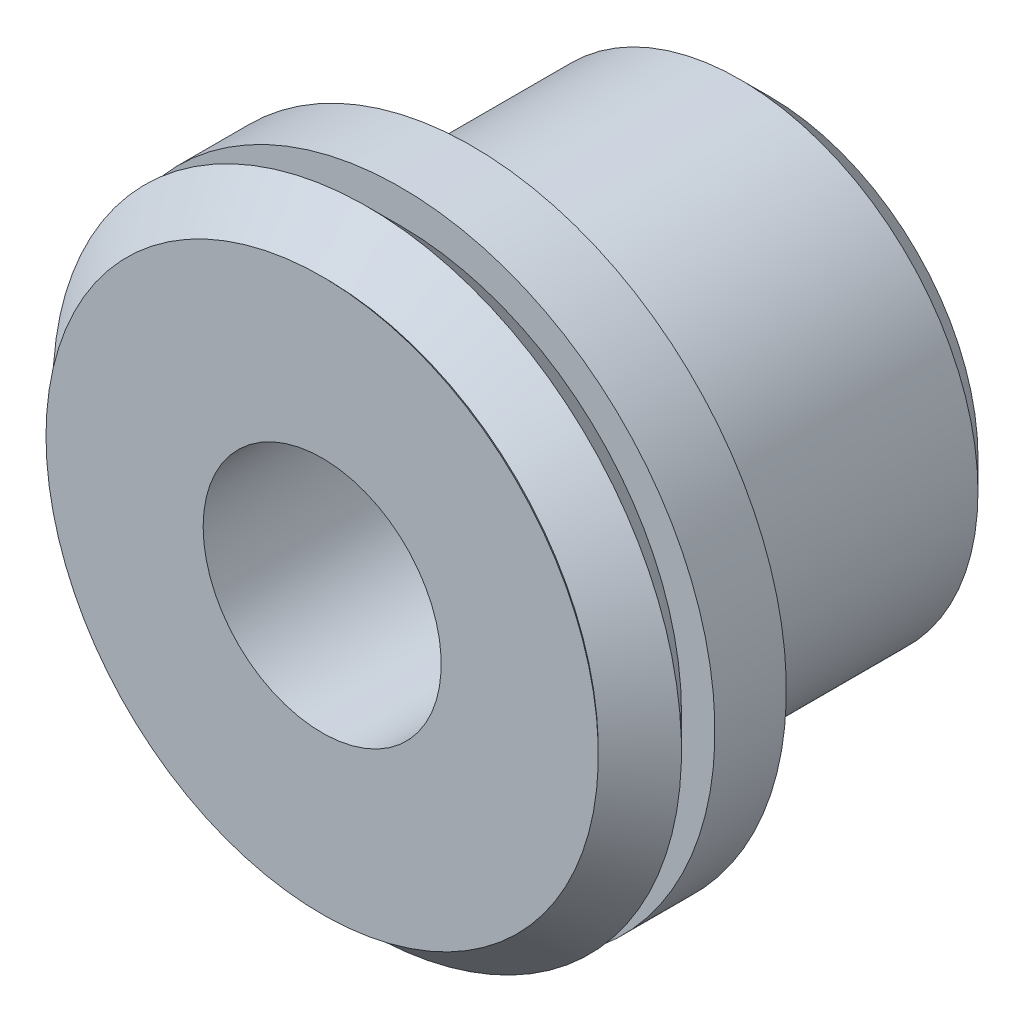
ISO-10303-21;
HEADER;
FILE_DESCRIPTION(('STEP AP214'),'2;1');
FILE_NAME('part.step','',(''),(''),'','','');
FILE_SCHEMA(('AUTOMOTIVE_DESIGN { 1 0 10303 214 1 1 1 1 }'));
ENDSEC;
DATA;
#1=APPLICATION_CONTEXT('core data for automotive mechanical design processes');
#2=APPLICATION_PROTOCOL_DEFINITION('international standard','automotive_design',2000,#1);
#3=PRODUCT_CONTEXT('',#1,'mechanical');
#4=PRODUCT('Part','Part','',(#3));
#5=PRODUCT_RELATED_PRODUCT_CATEGORY('part','',(#4));
#6=PRODUCT_DEFINITION_FORMATION('','',#4);
#7=PRODUCT_DEFINITION_CONTEXT('part definition',#1,'design');
#8=PRODUCT_DEFINITION('design','',#6,#7);
#9=PRODUCT_DEFINITION_SHAPE('','',#8);
#10=(LENGTH_UNIT() NAMED_UNIT(*) SI_UNIT(.MILLI.,.METRE.));
#11=(NAMED_UNIT(*) PLANE_ANGLE_UNIT() SI_UNIT($,.RADIAN.));
#12=(NAMED_UNIT(*) SI_UNIT($,.STERADIAN.) SOLID_ANGLE_UNIT());
#13=UNCERTAINTY_MEASURE_WITH_UNIT(LENGTH_MEASURE(1.E-05),#10,'distance_accuracy_value','');
#14=(GEOMETRIC_REPRESENTATION_CONTEXT(3) GLOBAL_UNCERTAINTY_ASSIGNED_CONTEXT((#13)) GLOBAL_UNIT_ASSIGNED_CONTEXT((#10,
#11,#12)) REPRESENTATION_CONTEXT('',''));
#15=CARTESIAN_POINT('',(0.,0.,0.));
#16=DIRECTION('',(0.,0.,1.));
#17=DIRECTION('',(1.,0.,0.));
#18=AXIS2_PLACEMENT_3D('',#15,#16,#17);
#19=CARTESIAN_POINT('',(0.,0.,0.));
#20=DIRECTION('',(0.,0.,1.));
#21=DIRECTION('',(1.,0.,0.));
#22=AXIS2_PLACEMENT_3D('',#19,#20,#21);
#23=PLANE('',#22);
#24=CARTESIAN_POINT('',(0.,0.,0.));
#25=DIRECTION('',(0.,0.,-1.));
#26=DIRECTION('',(-1.,0.,0.));
#27=AXIS2_PLACEMENT_3D('',#24,#25,#26);
#28=CIRCLE('',#27,7.366);
#29=CARTESIAN_POINT('',(-7.366,0.,0.));
#30=VERTEX_POINT('',#29);
#31=EDGE_CURVE('E45',#30,#30,#28,.T.);
#32=ORIENTED_EDGE('',*,*,#31,.F.);
#33=EDGE_LOOP('',(#32));
#34=FACE_BOUND('',#33,.T.);
#35=CARTESIAN_POINT('',(0.,0.,0.));
#36=DIRECTION('',(0.,0.,-1.));
#37=DIRECTION('',(-1.,0.,0.));
#38=AXIS2_PLACEMENT_3D('',#35,#36,#37);
#39=CIRCLE('',#38,3.175);
#40=CARTESIAN_POINT('',(-3.175,0.,0.));
#41=VERTEX_POINT('',#40);
#42=EDGE_CURVE('E66',#41,#41,#39,.T.);
#43=ORIENTED_EDGE('',*,*,#42,.T.);
#44=EDGE_LOOP('',(#43));
#45=FACE_BOUND('',#44,.T.);
#46=ADVANCED_FACE('F30',(#34,#45),#23,.T.);
#47=CARTESIAN_POINT('',(0.,0.,-11.935714));
#48=DIRECTION('',(0.,0.,1.));
#49=DIRECTION('',(1.,0.,0.));
#50=AXIS2_PLACEMENT_3D('',#47,#48,#49);
#51=PLANE('',#50);
#52=CARTESIAN_POINT('',(0.,0.,-11.935714));
#53=DIRECTION('',(0.,0.,1.));
#54=DIRECTION('',(1.,0.,0.));
#55=AXIS2_PLACEMENT_3D('',#52,#53,#54);
#56=CIRCLE('',#55,5.55624999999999);
#57=CARTESIAN_POINT('',(5.55624999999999,0.,-11.935714));
#58=VERTEX_POINT('',#57);
#59=EDGE_CURVE('E10',#58,#58,#56,.F.);
#60=ORIENTED_EDGE('',*,*,#59,.T.);
#61=EDGE_LOOP('',(#60));
#62=FACE_BOUND('',#61,.T.);
#63=CARTESIAN_POINT('',(0.,0.,-11.935714));
#64=DIRECTION('',(0.,0.,-1.));
#65=DIRECTION('',(-1.,0.,0.));
#66=AXIS2_PLACEMENT_3D('',#63,#64,#65);
#67=CIRCLE('',#66,3.175);
#68=CARTESIAN_POINT('',(-3.175,0.,-11.935714));
#69=VERTEX_POINT('',#68);
#70=EDGE_CURVE('E65',#69,#69,#67,.T.);
#71=ORIENTED_EDGE('',*,*,#70,.F.);
#72=EDGE_LOOP('',(#71));
#73=FACE_BOUND('',#72,.T.);
#74=ADVANCED_FACE('F75',(#62,#73),#51,.F.);
#75=CARTESIAN_POINT('',(0.,0.,-0.0927099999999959));
#76=DIRECTION('',(0.,0.,1.));
#77=DIRECTION('',(1.,0.,0.));
#78=AXIS2_PLACEMENT_3D('',#75,#76,#77);
#79=CONICAL_SURFACE('',#78,7.27329,0.785398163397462);
#80=ORIENTED_EDGE('',*,*,#31,.T.);
#81=EDGE_LOOP('',(#80));
#82=FACE_BOUND('',#81,.T.);
#83=CARTESIAN_POINT('',(0.,0.,-0.0927099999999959));
#84=DIRECTION('',(0.,0.,-1.));
#85=DIRECTION('',(-1.,0.,0.));
#86=AXIS2_PLACEMENT_3D('',#83,#84,#85);
#87=CIRCLE('',#86,7.27329);
#88=CARTESIAN_POINT('',(-7.27329,0.,-0.0927099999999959));
#89=VERTEX_POINT('',#88);
#90=EDGE_CURVE('E50',#89,#89,#87,.T.);
#91=ORIENTED_EDGE('',*,*,#90,.F.);
#92=EDGE_LOOP('',(#91));
#93=FACE_BOUND('',#92,.T.);
#94=ADVANCED_FACE('F77',(#82,#93),#79,.T.);
#95=CARTESIAN_POINT('',(0.,0.,-1.20141999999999));
#96=DIRECTION('',(0.,0.,-1.));
#97=DIRECTION('',(-1.,0.,0.));
#98=AXIS2_PLACEMENT_3D('',#95,#96,#97);
#99=CONICAL_SURFACE('',#98,8.38199999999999,0.785398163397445);
#100=ORIENTED_EDGE('',*,*,#90,.T.);
#101=EDGE_LOOP('',(#100));
#102=FACE_BOUND('',#101,.T.);
#103=CARTESIAN_POINT('',(0.,0.,-1.20141999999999));
#104=DIRECTION('',(0.,0.,-1.));
#105=DIRECTION('',(-1.,0.,0.));
#106=AXIS2_PLACEMENT_3D('',#103,#104,#105);
#107=CIRCLE('',#106,8.38199999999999);
#108=CARTESIAN_POINT('',(-8.38199999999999,0.,-1.20141999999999));
#109=VERTEX_POINT('',#108);
#110=EDGE_CURVE('E53',#109,#109,#107,.T.);
#111=ORIENTED_EDGE('',*,*,#110,.F.);
#112=EDGE_LOOP('',(#111));
#113=FACE_BOUND('',#112,.T.);
#114=ADVANCED_FACE('F83',(#102,#113),#99,.T.);
#115=CARTESIAN_POINT('',(0.,0.,-2.093214));
#116=DIRECTION('',(0.,0.,1.));
#117=DIRECTION('',(1.,0.,0.));
#118=AXIS2_PLACEMENT_3D('',#115,#116,#117);
#119=CONICAL_SURFACE('',#118,7.49020599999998,0.785398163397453);
#120=ORIENTED_EDGE('',*,*,#110,.T.);
#121=EDGE_LOOP('',(#120));
#122=FACE_BOUND('',#121,.T.);
#123=CARTESIAN_POINT('',(0.,0.,-2.093214));
#124=DIRECTION('',(0.,0.,-1.));
#125=DIRECTION('',(-1.,0.,0.));
#126=AXIS2_PLACEMENT_3D('',#123,#124,#125);
#127=CIRCLE('',#126,7.49020599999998);
#128=CARTESIAN_POINT('',(-7.49020599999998,0.,-2.093214));
#129=VERTEX_POINT('',#128);
#130=EDGE_CURVE('E56',#129,#129,#127,.T.);
#131=ORIENTED_EDGE('',*,*,#130,.F.);
#132=EDGE_LOOP('',(#131));
#133=FACE_BOUND('',#132,.T.);
#134=ADVANCED_FACE('F103',(#122,#133),#119,.T.);
#135=CARTESIAN_POINT('',(0.,7.49020599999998,-2.093214));
#136=DIRECTION('',(0.,0.,1.));
#137=DIRECTION('',(1.,0.,0.));
#138=AXIS2_PLACEMENT_3D('',#135,#136,#137);
#139=PLANE('',#138);
#140=ORIENTED_EDGE('',*,*,#130,.T.);
#141=EDGE_LOOP('',(#140));
#142=FACE_BOUND('',#141,.T.);
#143=CARTESIAN_POINT('',(0.,0.,-2.093214));
#144=DIRECTION('',(0.,0.,-1.));
#145=DIRECTION('',(-1.,0.,0.));
#146=AXIS2_PLACEMENT_3D('',#143,#144,#145);
#147=CIRCLE('',#146,8.38199999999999);
#148=CARTESIAN_POINT('',(-8.38199999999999,0.,-2.093214));
#149=VERTEX_POINT('',#148);
#150=EDGE_CURVE('E59',#149,#149,#147,.T.);
#151=ORIENTED_EDGE('',*,*,#150,.F.);
#152=EDGE_LOOP('',(#151));
#153=FACE_BOUND('',#152,.T.);
#154=ADVANCED_FACE('F99',(#142,#153),#139,.T.);
#155=CARTESIAN_POINT('',(0.,0.,-71.2941240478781));
#156=DIRECTION('',(0.,0.,-1.));
#157=DIRECTION('',(-1.,0.,0.));
#158=AXIS2_PLACEMENT_3D('',#155,#156,#157);
#159=CYLINDRICAL_SURFACE('',#158,8.38199999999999);
#160=ORIENTED_EDGE('',*,*,#150,.T.);
#161=EDGE_LOOP('',(#160));
#162=FACE_BOUND('',#161,.T.);
#163=CARTESIAN_POINT('',(0.,0.,-3.998214));
#164=DIRECTION('',(0.,0.,-1.));
#165=DIRECTION('',(-1.,0.,0.));
#166=AXIS2_PLACEMENT_3D('',#163,#164,#165);
#167=CIRCLE('',#166,8.38199999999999);
#168=CARTESIAN_POINT('',(-8.38199999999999,0.,-3.998214));
#169=VERTEX_POINT('',#168);
#170=EDGE_CURVE('E62',#169,#169,#167,.T.);
#171=ORIENTED_EDGE('',*,*,#170,.F.);
#172=EDGE_LOOP('',(#171));
#173=FACE_BOUND('',#172,.T.);
#174=ADVANCED_FACE('F95',(#162,#173),#159,.T.);
#175=CARTESIAN_POINT('',(0.,8.38199999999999,-3.998214));
#176=DIRECTION('',(0.,0.,-1.));
#177=DIRECTION('',(-1.,0.,0.));
#178=AXIS2_PLACEMENT_3D('',#175,#176,#177);
#179=PLANE('',#178);
#180=CARTESIAN_POINT('',(0.,0.,-3.998214));
#181=DIRECTION('',(0.,0.,-1.));
#182=DIRECTION('',(-1.,0.,0.));
#183=AXIS2_PLACEMENT_3D('',#180,#181,#182);
#184=CIRCLE('',#183,6.35);
#185=CARTESIAN_POINT('',(-6.35,0.,-3.998214));
#186=VERTEX_POINT('',#185);
#187=EDGE_CURVE('E41',#186,#186,#184,.T.);
#188=ORIENTED_EDGE('',*,*,#187,.F.);
#189=EDGE_LOOP('',(#188));
#190=FACE_BOUND('',#189,.T.);
#191=ORIENTED_EDGE('',*,*,#170,.T.);
#192=EDGE_LOOP('',(#191));
#193=FACE_BOUND('',#192,.T.);
#194=ADVANCED_FACE('F92',(#190,#193),#179,.T.);
#195=CARTESIAN_POINT('',(0.,0.,-11.935714));
#196=DIRECTION('',(0.,0.,1.));
#197=DIRECTION('',(1.,0.,0.));
#198=AXIS2_PLACEMENT_3D('',#195,#196,#197);
#199=CYLINDRICAL_SURFACE('',#198,6.35);
#200=CARTESIAN_POINT('',(0.,0.,-11.141964));
#201=DIRECTION('',(0.,0.,1.));
#202=DIRECTION('',(1.,0.,0.));
#203=AXIS2_PLACEMENT_3D('',#200,#201,#202);
#204=CIRCLE('',#203,6.35);
#205=CARTESIAN_POINT('',(6.35,0.,-11.141964));
#206=VERTEX_POINT('',#205);
#207=EDGE_CURVE('E37',#206,#206,#204,.T.);
#208=ORIENTED_EDGE('',*,*,#207,.T.);
#209=EDGE_LOOP('',(#208));
#210=FACE_BOUND('',#209,.T.);
#211=ORIENTED_EDGE('',*,*,#187,.T.);
#212=EDGE_LOOP('',(#211));
#213=FACE_BOUND('',#212,.T.);
#214=ADVANCED_FACE('F89',(#210,#213),#199,.T.);
#215=CARTESIAN_POINT('',(0.,0.,-11.141964));
#216=DIRECTION('',(0.,0.,1.));
#217=DIRECTION('',(1.,0.,0.));
#218=AXIS2_PLACEMENT_3D('',#215,#216,#217);
#219=CONICAL_SURFACE('',#218,6.35,0.78539816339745);
#220=CARTESIAN_POINT('',(5.55624999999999,0.,-11.935714));
#221=CARTESIAN_POINT('',(5.56451822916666,0.,-11.9274457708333));
#222=CARTESIAN_POINT('',(5.57278645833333,0.,-11.9191775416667));
#223=CARTESIAN_POINT('',(5.58932291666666,0.,-11.9026410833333));
#224=CARTESIAN_POINT('',(5.59759114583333,0.,-11.8943728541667));
#225=CARTESIAN_POINT('',(5.61412760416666,0.,-11.8778363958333));
#226=CARTESIAN_POINT('',(5.62239583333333,0.,-11.8695681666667));
#227=CARTESIAN_POINT('',(5.63893229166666,0.,-11.8530317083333));
#228=CARTESIAN_POINT('',(5.64720052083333,0.,-11.8447634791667));
#229=CARTESIAN_POINT('',(5.66373697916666,0.,-11.8282270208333));
#230=CARTESIAN_POINT('',(5.67200520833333,0.,-11.8199587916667));
#231=CARTESIAN_POINT('',(5.68854166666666,0.,-11.8034223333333));
#232=CARTESIAN_POINT('',(5.69680989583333,0.,-11.7951541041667));
#233=CARTESIAN_POINT('',(5.71334635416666,0.,-11.7786176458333));
#234=CARTESIAN_POINT('',(5.72161458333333,0.,-11.7703494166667));
#235=CARTESIAN_POINT('',(5.73815104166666,0.,-11.7538129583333));
#236=CARTESIAN_POINT('',(5.74641927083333,0.,-11.7455447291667));
#237=CARTESIAN_POINT('',(5.76295572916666,0.,-11.7290082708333));
#238=CARTESIAN_POINT('',(5.77122395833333,0.,-11.7207400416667));
#239=CARTESIAN_POINT('',(5.78776041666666,0.,-11.7042035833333));
#240=CARTESIAN_POINT('',(5.79602864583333,0.,-11.6959353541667));
#241=CARTESIAN_POINT('',(5.81256510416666,0.,-11.6793988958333));
#242=CARTESIAN_POINT('',(5.82083333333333,0.,-11.6711306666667));
#243=CARTESIAN_POINT('',(5.83736979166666,0.,-11.6545942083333));
#244=CARTESIAN_POINT('',(5.84563802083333,0.,-11.6463259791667));
#245=CARTESIAN_POINT('',(5.86217447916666,0.,-11.6297895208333));
#246=CARTESIAN_POINT('',(5.87044270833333,0.,-11.6215212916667));
#247=CARTESIAN_POINT('',(5.88697916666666,0.,-11.6049848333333));
#248=CARTESIAN_POINT('',(5.89524739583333,0.,-11.5967166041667));
#249=CARTESIAN_POINT('',(5.91178385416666,0.,-11.5801801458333));
#250=CARTESIAN_POINT('',(5.92005208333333,0.,-11.5719119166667));
#251=CARTESIAN_POINT('',(5.93658854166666,0.,-11.5553754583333));
#252=CARTESIAN_POINT('',(5.94485677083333,0.,-11.5471072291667));
#253=CARTESIAN_POINT('',(5.96139322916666,0.,-11.5305707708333));
#254=CARTESIAN_POINT('',(5.96966145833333,0.,-11.5223025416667));
#255=CARTESIAN_POINT('',(5.98619791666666,0.,-11.5057660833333));
#256=CARTESIAN_POINT('',(5.99446614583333,0.,-11.4974978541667));
#257=CARTESIAN_POINT('',(6.01100260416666,0.,-11.4809613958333));
#258=CARTESIAN_POINT('',(6.01927083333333,0.,-11.4726931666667));
#259=CARTESIAN_POINT('',(6.03580729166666,0.,-11.4561567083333));
#260=CARTESIAN_POINT('',(6.04407552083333,0.,-11.4478884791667));
#261=CARTESIAN_POINT('',(6.06061197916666,0.,-11.4313520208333));
#262=CARTESIAN_POINT('',(6.06888020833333,0.,-11.4230837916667));
#263=CARTESIAN_POINT('',(6.08541666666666,0.,-11.4065473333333));
#264=CARTESIAN_POINT('',(6.09368489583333,0.,-11.3982791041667));
#265=CARTESIAN_POINT('',(6.11022135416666,0.,-11.3817426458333));
#266=CARTESIAN_POINT('',(6.11848958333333,0.,-11.3734744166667));
#267=CARTESIAN_POINT('',(6.13502604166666,0.,-11.3569379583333));
#268=CARTESIAN_POINT('',(6.14329427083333,0.,-11.3486697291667));
#269=CARTESIAN_POINT('',(6.15983072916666,0.,-11.3321332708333));
#270=CARTESIAN_POINT('',(6.16809895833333,0.,-11.3238650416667));
#271=CARTESIAN_POINT('',(6.18463541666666,0.,-11.3073285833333));
#272=CARTESIAN_POINT('',(6.19290364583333,0.,-11.2990603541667));
#273=CARTESIAN_POINT('',(6.20944010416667,0.,-11.2825238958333));
#274=CARTESIAN_POINT('',(6.21770833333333,0.,-11.2742556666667));
#275=CARTESIAN_POINT('',(6.23424479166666,0.,-11.2577192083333));
#276=CARTESIAN_POINT('',(6.24251302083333,0.,-11.2494509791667));
#277=CARTESIAN_POINT('',(6.25904947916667,0.,-11.2329145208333));
#278=CARTESIAN_POINT('',(6.26731770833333,0.,-11.2246462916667));
#279=CARTESIAN_POINT('',(6.28385416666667,0.,-11.2081098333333));
#280=CARTESIAN_POINT('',(6.29212239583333,0.,-11.1998416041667));
#281=CARTESIAN_POINT('',(6.30865885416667,0.,-11.1833051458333));
#282=CARTESIAN_POINT('',(6.31692708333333,0.,-11.1750369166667));
#283=CARTESIAN_POINT('',(6.33346354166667,0.,-11.1585004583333));
#284=CARTESIAN_POINT('',(6.34173177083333,0.,-11.1502322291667));
#285=CARTESIAN_POINT('',(6.35,0.,-11.141964));
#286=B_SPLINE_CURVE_WITH_KNOTS('',3,(#220,#221,#222,#223,#224,#225,#226,#227,#228,#229,#230,
#231,#232,#233,#234,#235,#236,#237,#238,#239,#240,#241,#242,#243,#244,#245,#246,#247,#248,#249,
#250,#251,#252,#253,#254,#255,#256,#257,#258,#259,#260,#261,#262,#263,#264,#265,#266,#267,#268,
#269,#270,#271,#272,#273,#274,#275,#276,#277,#278,#279,#280,#281,#282,#283,#284,#285),
.UNSPECIFIED.,.F.,.F.,(4,2,2,2,2,2,2,2,2,2,2,2,2,2,2,2,2,2,2,2,2,2,2,2,2,2,2,2,2,2,2,2,4),(0.,
0.0350791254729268,0.070158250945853,0.10523737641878,0.140316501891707,0.175395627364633,
0.21047475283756,0.245553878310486,0.280633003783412,0.315712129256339,0.350791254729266,
0.385870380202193,0.420949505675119,0.456028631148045,0.491107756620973,0.526186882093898,
0.561266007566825,0.596345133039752,0.631424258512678,0.666503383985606,0.701582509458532,
0.736661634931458,0.771740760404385,0.806819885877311,0.841899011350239,0.876978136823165,
0.912057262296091,0.947136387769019,0.982215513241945,1.01729463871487,1.0523737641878,
1.08745288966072,1.12253201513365),.UNSPECIFIED.);
#287=EDGE_CURVE('BSEAM32',#58,#206,#286,.T.);
#288=ORIENTED_EDGE('',*,*,#59,.F.);
#289=ORIENTED_EDGE('',*,*,#207,.F.);
#290=ORIENTED_EDGE('',*,*,#287,.T.);
#291=ORIENTED_EDGE('',*,*,#287,.F.);
#292=EDGE_LOOP('',(#288,#290,#289,#291));
#293=FACE_BOUND('',#292,.T.);
#294=ADVANCED_FACE('F32',(#293),#219,.T.);
#295=CARTESIAN_POINT('',(0.,0.,-11.935714));
#296=DIRECTION('',(0.,0.,1.));
#297=DIRECTION('',(1.,0.,0.));
#298=AXIS2_PLACEMENT_3D('',#295,#296,#297);
#299=CYLINDRICAL_SURFACE('',#298,3.175);
#300=ORIENTED_EDGE('',*,*,#70,.T.);
#301=EDGE_LOOP('',(#300));
#302=FACE_BOUND('',#301,.T.);
#303=ORIENTED_EDGE('',*,*,#42,.F.);
#304=EDGE_LOOP('',(#303));
#305=FACE_BOUND('',#304,.T.);
#306=ADVANCED_FACE('F72',(#302,#305),#299,.F.);
#307=CLOSED_SHELL('',(#46,#74,#94,#114,#134,#154,#174,#194,#214,#294,#306));
#308=MANIFOLD_SOLID_BREP('B2',#307);
#309=ADVANCED_BREP_SHAPE_REPRESENTATION('',(#18,#308),#14);
#310=SHAPE_DEFINITION_REPRESENTATION(#9,#309);
ENDSEC;
END-ISO-10303-21;
